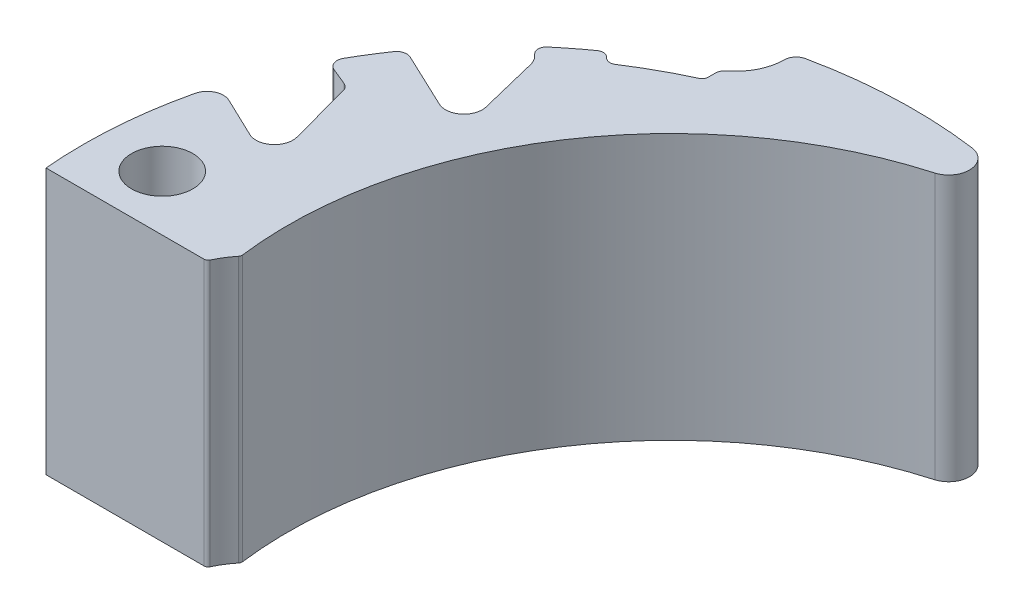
ISO-10303-21;
HEADER;
FILE_DESCRIPTION(('STEP AP214'),'2;1');
FILE_NAME('part.step','',(''),(''),'','','');
FILE_SCHEMA(('AUTOMOTIVE_DESIGN { 1 0 10303 214 1 1 1 1 }'));
ENDSEC;
DATA;
#1=APPLICATION_CONTEXT('core data for automotive mechanical design processes');
#2=APPLICATION_PROTOCOL_DEFINITION('international standard','automotive_design',2000,#1);
#3=PRODUCT_CONTEXT('',#1,'mechanical');
#4=PRODUCT('Part','Part','',(#3));
#5=PRODUCT_RELATED_PRODUCT_CATEGORY('part','',(#4));
#6=PRODUCT_DEFINITION_FORMATION('','',#4);
#7=PRODUCT_DEFINITION_CONTEXT('part definition',#1,'design');
#8=PRODUCT_DEFINITION('design','',#6,#7);
#9=PRODUCT_DEFINITION_SHAPE('','',#8);
#10=(LENGTH_UNIT() NAMED_UNIT(*) SI_UNIT(.MILLI.,.METRE.));
#11=(NAMED_UNIT(*) PLANE_ANGLE_UNIT() SI_UNIT($,.RADIAN.));
#12=(NAMED_UNIT(*) SI_UNIT($,.STERADIAN.) SOLID_ANGLE_UNIT());
#13=UNCERTAINTY_MEASURE_WITH_UNIT(LENGTH_MEASURE(1.E-05),#10,'distance_accuracy_value','');
#14=(GEOMETRIC_REPRESENTATION_CONTEXT(3) GLOBAL_UNCERTAINTY_ASSIGNED_CONTEXT((#13)) GLOBAL_UNIT_ASSIGNED_CONTEXT((#10,
#11,#12)) REPRESENTATION_CONTEXT('',''));
#15=CARTESIAN_POINT('',(0.,0.,0.));
#16=DIRECTION('',(0.,0.,1.));
#17=DIRECTION('',(1.,0.,0.));
#18=AXIS2_PLACEMENT_3D('',#15,#16,#17);
#19=CARTESIAN_POINT('',(144.723717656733,13.,-142.292933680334));
#20=DIRECTION('',(0.,-1.,0.));
#21=DIRECTION('',(0.,0.,-1.));
#22=AXIS2_PLACEMENT_3D('',#19,#20,#21);
#23=CYLINDRICAL_SURFACE('',#22,18.75);
#24=CARTESIAN_POINT('',(144.723717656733,0.,-142.292933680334));
#25=DIRECTION('',(0.,1.,0.));
#26=DIRECTION('',(0.,0.,1.));
#27=AXIS2_PLACEMENT_3D('',#24,#25,#26);
#28=CIRCLE('',#27,18.75);
#29=CARTESIAN_POINT('',(139.594538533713,0.,-160.327733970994));
#30=VERTEX_POINT('',#29);
#31=CARTESIAN_POINT('',(126.124865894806,0.,-139.916967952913));
#32=VERTEX_POINT('',#31);
#33=EDGE_CURVE('E284',#30,#32,#28,.T.);
#34=ORIENTED_EDGE('',*,*,#33,.F.);
#35=DIRECTION('',(0.,-1.,0.));
#36=VECTOR('',#35,1.);
#37=CARTESIAN_POINT('',(139.594538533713,13.,-160.327733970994));
#38=LINE('',#37,#36);
#39=CARTESIAN_POINT('',(139.594538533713,13.,-160.327733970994));
#40=VERTEX_POINT('',#39);
#41=EDGE_CURVE('E11',#40,#30,#38,.T.);
#42=ORIENTED_EDGE('',*,*,#41,.F.);
#43=CARTESIAN_POINT('',(144.723717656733,13.,-142.292933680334));
#44=DIRECTION('',(0.,1.,0.));
#45=DIRECTION('',(0.,0.,1.));
#46=AXIS2_PLACEMENT_3D('',#43,#44,#45);
#47=CIRCLE('',#46,18.75);
#48=CARTESIAN_POINT('',(126.124865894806,13.,-139.916967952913));
#49=VERTEX_POINT('',#48);
#50=EDGE_CURVE('E370',#40,#49,#47,.T.);
#51=ORIENTED_EDGE('',*,*,#50,.T.);
#52=DIRECTION('',(0.,-1.,0.));
#53=VECTOR('',#52,1.);
#54=CARTESIAN_POINT('',(126.124865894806,13.,-139.916967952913));
#55=LINE('',#54,#53);
#56=EDGE_CURVE('E57',#49,#32,#55,.T.);
#57=ORIENTED_EDGE('',*,*,#56,.T.);
#58=EDGE_LOOP('',(#34,#42,#51,#57));
#59=FACE_BOUND('',#58,.T.);
#60=ADVANCED_FACE('F41',(#59),#23,.F.);
#61=CARTESIAN_POINT('',(139.295638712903,13.,-161.297169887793));
#62=DIRECTION('',(0.,-1.,0.));
#63=DIRECTION('',(0.,0.,-1.));
#64=AXIS2_PLACEMENT_3D('',#61,#62,#63);
#65=CYLINDRICAL_SURFACE('',#64,1.01446887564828);
#66=CARTESIAN_POINT('',(139.295638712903,0.,-161.297169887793));
#67=DIRECTION('',(0.,1.,0.));
#68=DIRECTION('',(0.,0.,1.));
#69=AXIS2_PLACEMENT_3D('',#66,#67,#68);
#70=CIRCLE('',#69,1.01446887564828);
#71=CARTESIAN_POINT('',(139.432329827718,0.,-162.302387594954));
#72=VERTEX_POINT('',#71);
#73=EDGE_CURVE('E286',#30,#72,#70,.T.);
#74=ORIENTED_EDGE('',*,*,#73,.T.);
#75=DIRECTION('',(0.,-1.,0.));
#76=VECTOR('',#75,1.);
#77=CARTESIAN_POINT('',(139.432329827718,13.,-162.302387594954));
#78=LINE('',#77,#76);
#79=CARTESIAN_POINT('',(139.432329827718,13.,-162.302387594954));
#80=VERTEX_POINT('',#79);
#81=EDGE_CURVE('E49',#80,#72,#78,.T.);
#82=ORIENTED_EDGE('',*,*,#81,.F.);
#83=CARTESIAN_POINT('',(139.295638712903,13.,-161.297169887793));
#84=DIRECTION('',(0.,1.,0.));
#85=DIRECTION('',(0.,0.,1.));
#86=AXIS2_PLACEMENT_3D('',#83,#84,#85);
#87=CIRCLE('',#86,1.01446887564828);
#88=EDGE_CURVE('E462',#40,#80,#87,.T.);
#89=ORIENTED_EDGE('',*,*,#88,.F.);
#90=ORIENTED_EDGE('',*,*,#41,.T.);
#91=EDGE_LOOP('',(#74,#82,#89,#90));
#92=FACE_BOUND('',#91,.T.);
#93=ADVANCED_FACE('F537',(#92),#65,.T.);
#94=CARTESIAN_POINT('',(136.348769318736,13.,-139.626081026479));
#95=DIRECTION('',(0.,-1.,0.));
#96=DIRECTION('',(0.,0.,-1.));
#97=AXIS2_PLACEMENT_3D('',#94,#95,#96);
#98=CYLINDRICAL_SURFACE('',#97,22.885);
#99=CARTESIAN_POINT('',(136.348769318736,0.,-139.626081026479));
#100=DIRECTION('',(0.,1.,0.));
#101=DIRECTION('',(0.,0.,1.));
#102=AXIS2_PLACEMENT_3D('',#99,#100,#101);
#103=CIRCLE('',#102,22.885);
#104=CARTESIAN_POINT('',(131.569829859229,0.,-162.006540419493));
#105=VERTEX_POINT('',#104);
#106=EDGE_CURVE('E289',#72,#105,#103,.T.);
#107=ORIENTED_EDGE('',*,*,#106,.T.);
#108=DIRECTION('',(0.,-1.,0.));
#109=VECTOR('',#108,1.);
#110=CARTESIAN_POINT('',(131.569829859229,13.,-162.006540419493));
#111=LINE('',#110,#109);
#112=CARTESIAN_POINT('',(131.569829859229,13.,-162.006540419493));
#113=VERTEX_POINT('',#112);
#114=EDGE_CURVE('E434',#113,#105,#111,.T.);
#115=ORIENTED_EDGE('',*,*,#114,.F.);
#116=CARTESIAN_POINT('',(136.348769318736,13.,-139.626081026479));
#117=DIRECTION('',(0.,1.,0.));
#118=DIRECTION('',(0.,0.,1.));
#119=AXIS2_PLACEMENT_3D('',#116,#117,#118);
#120=CIRCLE('',#119,22.885);
#121=EDGE_CURVE('E443',#80,#113,#120,.T.);
#122=ORIENTED_EDGE('',*,*,#121,.F.);
#123=ORIENTED_EDGE('',*,*,#81,.T.);
#124=EDGE_LOOP('',(#107,#115,#122,#123));
#125=FACE_BOUND('',#124,.T.);
#126=ADVANCED_FACE('F441',(#125),#98,.T.);
#127=CARTESIAN_POINT('',(131.691443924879,13.,-161.437004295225));
#128=DIRECTION('',(0.,-1.,0.));
#129=DIRECTION('',(0.,0.,-1.));
#130=AXIS2_PLACEMENT_3D('',#127,#128,#129);
#131=CYLINDRICAL_SURFACE('',#130,0.582375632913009);
#132=CARTESIAN_POINT('',(131.691443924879,0.,-161.437004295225));
#133=DIRECTION('',(0.,1.,0.));
#134=DIRECTION('',(0.,0.,1.));
#135=AXIS2_PLACEMENT_3D('',#132,#133,#134);
#136=CIRCLE('',#135,0.582375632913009);
#137=CARTESIAN_POINT('',(131.109080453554,0.,-161.440767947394));
#138=VERTEX_POINT('',#137);
#139=EDGE_CURVE('E291',#105,#138,#136,.T.);
#140=ORIENTED_EDGE('',*,*,#139,.T.);
#141=DIRECTION('',(0.,-1.,0.));
#142=VECTOR('',#141,1.);
#143=CARTESIAN_POINT('',(131.109080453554,13.,-161.440767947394));
#144=LINE('',#143,#142);
#145=CARTESIAN_POINT('',(131.109080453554,13.,-161.440767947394));
#146=VERTEX_POINT('',#145);
#147=EDGE_CURVE('E432',#146,#138,#144,.T.);
#148=ORIENTED_EDGE('',*,*,#147,.F.);
#149=CARTESIAN_POINT('',(131.691443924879,13.,-161.437004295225));
#150=DIRECTION('',(0.,1.,0.));
#151=DIRECTION('',(0.,0.,1.));
#152=AXIS2_PLACEMENT_3D('',#149,#150,#151);
#153=CIRCLE('',#152,0.582375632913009);
#154=EDGE_CURVE('E456',#113,#146,#153,.T.);
#155=ORIENTED_EDGE('',*,*,#154,.F.);
#156=ORIENTED_EDGE('',*,*,#114,.T.);
#157=EDGE_LOOP('',(#140,#148,#155,#156));
#158=FACE_BOUND('',#157,.T.);
#159=ADVANCED_FACE('F453',(#158),#131,.T.);
#160=CARTESIAN_POINT('',(128.731780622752,13.,-161.456131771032));
#161=DIRECTION('',(0.,-1.,0.));
#162=DIRECTION('',(0.,0.,-1.));
#163=AXIS2_PLACEMENT_3D('',#160,#161,#162);
#164=CYLINDRICAL_SURFACE('',#163,2.37734947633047);
#165=CARTESIAN_POINT('',(128.731780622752,0.,-161.456131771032));
#166=DIRECTION('',(0.,1.,0.));
#167=DIRECTION('',(0.,0.,1.));
#168=AXIS2_PLACEMENT_3D('',#165,#166,#167);
#169=CIRCLE('',#168,2.37734947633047);
#170=CARTESIAN_POINT('',(130.179324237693,0.,-159.57028765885));
#171=VERTEX_POINT('',#170);
#172=EDGE_CURVE('E294',#171,#138,#169,.T.);
#173=ORIENTED_EDGE('',*,*,#172,.F.);
#174=DIRECTION('',(0.,-1.,0.));
#175=VECTOR('',#174,1.);
#176=CARTESIAN_POINT('',(130.179324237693,13.,-159.57028765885));
#177=LINE('',#176,#175);
#178=CARTESIAN_POINT('',(130.179324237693,13.,-159.57028765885));
#179=VERTEX_POINT('',#178);
#180=EDGE_CURVE('E430',#179,#171,#177,.T.);
#181=ORIENTED_EDGE('',*,*,#180,.F.);
#182=CARTESIAN_POINT('',(128.731780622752,13.,-161.456131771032));
#183=DIRECTION('',(0.,1.,0.));
#184=DIRECTION('',(0.,0.,1.));
#185=AXIS2_PLACEMENT_3D('',#182,#183,#184);
#186=CIRCLE('',#185,2.37734947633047);
#187=EDGE_CURVE('E458',#179,#146,#186,.T.);
#188=ORIENTED_EDGE('',*,*,#187,.T.);
#189=ORIENTED_EDGE('',*,*,#147,.T.);
#190=EDGE_LOOP('',(#173,#181,#188,#189));
#191=FACE_BOUND('',#190,.T.);
#192=ADVANCED_FACE('F548',(#191),#164,.F.);
#193=CARTESIAN_POINT('',(130.483769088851,13.,-159.173660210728));
#194=DIRECTION('',(0.,-1.,0.));
#195=DIRECTION('',(0.,0.,-1.));
#196=AXIS2_PLACEMENT_3D('',#193,#194,#195);
#197=CYLINDRICAL_SURFACE('',#196,0.500000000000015);
#198=CARTESIAN_POINT('',(130.483769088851,0.,-159.173660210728));
#199=DIRECTION('',(0.,1.,0.));
#200=DIRECTION('',(0.,0.,1.));
#201=AXIS2_PLACEMENT_3D('',#198,#199,#200);
#202=CIRCLE('',#201,0.500000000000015);
#203=CARTESIAN_POINT('',(129.983769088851,0.,-159.173660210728));
#204=VERTEX_POINT('',#203);
#205=EDGE_CURVE('E297',#171,#204,#202,.T.);
#206=ORIENTED_EDGE('',*,*,#205,.T.);
#207=DIRECTION('',(0.,-1.,0.));
#208=VECTOR('',#207,1.);
#209=CARTESIAN_POINT('',(129.983769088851,13.,-159.173660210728));
#210=LINE('',#209,#208);
#211=CARTESIAN_POINT('',(129.983769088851,13.,-159.173660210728));
#212=VERTEX_POINT('',#211);
#213=EDGE_CURVE('E428',#212,#204,#210,.T.);
#214=ORIENTED_EDGE('',*,*,#213,.F.);
#215=CARTESIAN_POINT('',(130.483769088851,13.,-159.173660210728));
#216=DIRECTION('',(0.,1.,0.));
#217=DIRECTION('',(0.,0.,1.));
#218=AXIS2_PLACEMENT_3D('',#215,#216,#217);
#219=CIRCLE('',#218,0.500000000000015);
#220=EDGE_CURVE('E460',#179,#212,#219,.T.);
#221=ORIENTED_EDGE('',*,*,#220,.F.);
#222=ORIENTED_EDGE('',*,*,#180,.T.);
#223=EDGE_LOOP('',(#206,#214,#221,#222));
#224=FACE_BOUND('',#223,.T.);
#225=ADVANCED_FACE('F551',(#224),#197,.T.);
#226=CARTESIAN_POINT('',(129.983769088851,13.,0.));
#227=DIRECTION('',(-1.,0.,0.));
#228=DIRECTION('',(0.,0.,1.));
#229=AXIS2_PLACEMENT_3D('',#226,#227,#228);
#230=PLANE('',#229);
#231=DIRECTION('',(0.,0.,-1.));
#232=VECTOR('',#231,1.);
#233=CARTESIAN_POINT('',(129.983769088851,0.,0.));
#234=LINE('',#233,#232);
#235=CARTESIAN_POINT('',(129.983769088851,0.,-158.839172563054));
#236=VERTEX_POINT('',#235);
#237=EDGE_CURVE('E300',#236,#204,#234,.T.);
#238=ORIENTED_EDGE('',*,*,#237,.F.);
#239=DIRECTION('',(0.,-1.,0.));
#240=VECTOR('',#239,1.);
#241=CARTESIAN_POINT('',(129.983769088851,13.,-158.839172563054));
#242=LINE('',#241,#240);
#243=CARTESIAN_POINT('',(129.983769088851,13.,-158.839172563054));
#244=VERTEX_POINT('',#243);
#245=EDGE_CURVE('E426',#244,#236,#242,.T.);
#246=ORIENTED_EDGE('',*,*,#245,.F.);
#247=DIRECTION('',(0.,0.,-1.));
#248=VECTOR('',#247,1.);
#249=CARTESIAN_POINT('',(129.983769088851,13.,0.));
#250=LINE('',#249,#248);
#251=EDGE_CURVE('E467',#244,#212,#250,.T.);
#252=ORIENTED_EDGE('',*,*,#251,.T.);
#253=ORIENTED_EDGE('',*,*,#213,.T.);
#254=EDGE_LOOP('',(#238,#246,#252,#253));
#255=FACE_BOUND('',#254,.T.);
#256=ADVANCED_FACE('F555',(#255),#230,.T.);
#257=CARTESIAN_POINT('',(129.683769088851,13.,-158.839172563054));
#258=DIRECTION('',(0.,-1.,0.));
#259=DIRECTION('',(0.,0.,-1.));
#260=AXIS2_PLACEMENT_3D('',#257,#258,#259);
#261=CYLINDRICAL_SURFACE('',#260,0.300000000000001);
#262=CARTESIAN_POINT('',(129.683769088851,0.,-158.839172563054));
#263=DIRECTION('',(0.,1.,0.));
#264=DIRECTION('',(0.,0.,1.));
#265=AXIS2_PLACEMENT_3D('',#262,#263,#264);
#266=CIRCLE('',#265,0.300000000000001);
#267=CARTESIAN_POINT('',(129.807926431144,0.,-158.566070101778));
#268=VERTEX_POINT('',#267);
#269=EDGE_CURVE('E303',#236,#268,#266,.F.);
#270=ORIENTED_EDGE('',*,*,#269,.T.);
#271=DIRECTION('',(0.,-1.,0.));
#272=VECTOR('',#271,1.);
#273=CARTESIAN_POINT('',(129.807926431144,13.,-158.566070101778));
#274=LINE('',#273,#272);
#275=CARTESIAN_POINT('',(129.807926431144,13.,-158.566070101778));
#276=VERTEX_POINT('',#275);
#277=EDGE_CURVE('E423',#276,#268,#274,.T.);
#278=ORIENTED_EDGE('',*,*,#277,.F.);
#279=CARTESIAN_POINT('',(129.683769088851,13.,-158.839172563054));
#280=DIRECTION('',(0.,1.,0.));
#281=DIRECTION('',(0.,0.,1.));
#282=AXIS2_PLACEMENT_3D('',#279,#280,#281);
#283=CIRCLE('',#282,0.300000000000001);
#284=EDGE_CURVE('E470',#244,#276,#283,.F.);
#285=ORIENTED_EDGE('',*,*,#284,.F.);
#286=ORIENTED_EDGE('',*,*,#245,.T.);
#287=EDGE_LOOP('',(#270,#278,#285,#286));
#288=FACE_BOUND('',#287,.T.);
#289=ADVANCED_FACE('F559',(#288),#261,.F.);
#290=CARTESIAN_POINT('',(137.898846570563,13.,-140.768893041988));
#291=DIRECTION('',(0.,-1.,0.));
#292=DIRECTION('',(0.,0.,-1.));
#293=AXIS2_PLACEMENT_3D('',#290,#291,#292);
#294=CYLINDRICAL_SURFACE('',#293,19.55);
#295=CARTESIAN_POINT('',(137.898846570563,0.,-140.768893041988));
#296=DIRECTION('',(0.,1.,0.));
#297=DIRECTION('',(0.,0.,1.));
#298=AXIS2_PLACEMENT_3D('',#295,#296,#297);
#299=CIRCLE('',#298,19.55);
#300=CARTESIAN_POINT('',(127.183464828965,0.,-157.120745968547));
#301=VERTEX_POINT('',#300);
#302=EDGE_CURVE('E305',#268,#301,#299,.T.);
#303=ORIENTED_EDGE('',*,*,#302,.T.);
#304=DIRECTION('',(0.,-1.,0.));
#305=VECTOR('',#304,1.);
#306=CARTESIAN_POINT('',(127.183464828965,13.,-157.120745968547));
#307=LINE('',#306,#305);
#308=CARTESIAN_POINT('',(127.183464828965,13.,-157.120745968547));
#309=VERTEX_POINT('',#308);
#310=EDGE_CURVE('E420',#309,#301,#307,.T.);
#311=ORIENTED_EDGE('',*,*,#310,.F.);
#312=CARTESIAN_POINT('',(137.898846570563,13.,-140.768893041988));
#313=DIRECTION('',(0.,1.,0.));
#314=DIRECTION('',(0.,0.,1.));
#315=AXIS2_PLACEMENT_3D('',#312,#313,#314);
#316=CIRCLE('',#315,19.55);
#317=EDGE_CURVE('E472',#276,#309,#316,.T.);
#318=ORIENTED_EDGE('',*,*,#317,.F.);
#319=ORIENTED_EDGE('',*,*,#277,.T.);
#320=EDGE_LOOP('',(#303,#311,#318,#319));
#321=FACE_BOUND('',#320,.T.);
#322=ADVANCED_FACE('F563',(#321),#294,.T.);
#323=CARTESIAN_POINT('',(126.964224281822,13.,-157.455310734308));
#324=DIRECTION('',(0.,-1.,0.));
#325=DIRECTION('',(0.,0.,-1.));
#326=AXIS2_PLACEMENT_3D('',#323,#324,#325);
#327=CYLINDRICAL_SURFACE('',#326,0.399999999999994);
#328=CARTESIAN_POINT('',(126.964224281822,0.,-157.455310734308));
#329=DIRECTION('',(0.,1.,0.));
#330=DIRECTION('',(0.,0.,1.));
#331=AXIS2_PLACEMENT_3D('',#328,#329,#330);
#332=CIRCLE('',#331,0.399999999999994);
#333=CARTESIAN_POINT('',(126.667017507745,0.,-157.187601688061));
#334=VERTEX_POINT('',#333);
#335=EDGE_CURVE('E307',#301,#334,#332,.F.);
#336=ORIENTED_EDGE('',*,*,#335,.T.);
#337=DIRECTION('',(0.,-1.,0.));
#338=VECTOR('',#337,1.);
#339=CARTESIAN_POINT('',(126.667017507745,13.,-157.187601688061));
#340=LINE('',#339,#338);
#341=CARTESIAN_POINT('',(126.667017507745,13.,-157.187601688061));
#342=VERTEX_POINT('',#341);
#343=EDGE_CURVE('E418',#342,#334,#340,.T.);
#344=ORIENTED_EDGE('',*,*,#343,.F.);
#345=CARTESIAN_POINT('',(126.964224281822,13.,-157.455310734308));
#346=DIRECTION('',(0.,1.,0.));
#347=DIRECTION('',(0.,0.,1.));
#348=AXIS2_PLACEMENT_3D('',#345,#346,#347);
#349=CIRCLE('',#348,0.399999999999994);
#350=EDGE_CURVE('E474',#309,#342,#349,.F.);
#351=ORIENTED_EDGE('',*,*,#350,.F.);
#352=ORIENTED_EDGE('',*,*,#310,.T.);
#353=EDGE_LOOP('',(#336,#344,#351,#352));
#354=FACE_BOUND('',#353,.T.);
#355=ADVANCED_FACE('F567',(#354),#327,.F.);
#356=CARTESIAN_POINT('',(148.095978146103,13.,-133.397474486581));
#357=DIRECTION('',(0.743016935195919,0.,-0.66927261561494));
#358=DIRECTION('',(-0.66927261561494,0.,-0.743016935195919));
#359=AXIS2_PLACEMENT_3D('',#356,#357,#358);
#360=PLANE('',#359);
#361=DIRECTION('',(0.66927261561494,0.,0.743016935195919));
#362=VECTOR('',#361,1.);
#363=CARTESIAN_POINT('',(148.095978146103,0.,-133.397474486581));
#364=LINE('',#363,#362);
#365=CARTESIAN_POINT('',(126.662791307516,0.,-157.192293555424));
#366=VERTEX_POINT('',#365);
#367=EDGE_CURVE('E310',#366,#334,#364,.T.);
#368=ORIENTED_EDGE('',*,*,#367,.F.);
#369=DIRECTION('',(0.,-1.,0.));
#370=VECTOR('',#369,1.);
#371=CARTESIAN_POINT('',(126.662791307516,13.,-157.192293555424));
#372=LINE('',#371,#370);
#373=CARTESIAN_POINT('',(126.662791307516,13.,-157.192293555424));
#374=VERTEX_POINT('',#373);
#375=EDGE_CURVE('E416',#374,#366,#372,.T.);
#376=ORIENTED_EDGE('',*,*,#375,.F.);
#377=DIRECTION('',(0.66927261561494,0.,0.743016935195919));
#378=VECTOR('',#377,1.);
#379=CARTESIAN_POINT('',(148.095978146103,13.,-133.397474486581));
#380=LINE('',#379,#378);
#381=EDGE_CURVE('E476',#374,#342,#380,.T.);
#382=ORIENTED_EDGE('',*,*,#381,.T.);
#383=ORIENTED_EDGE('',*,*,#343,.T.);
#384=EDGE_LOOP('',(#368,#376,#382,#383));
#385=FACE_BOUND('',#384,.T.);
#386=ADVANCED_FACE('F571',(#385),#360,.T.);
#387=CARTESIAN_POINT('',(126.365584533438,13.,-156.924584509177));
#388=DIRECTION('',(0.,-1.,0.));
#389=DIRECTION('',(0.,0.,-1.));
#390=AXIS2_PLACEMENT_3D('',#387,#388,#389);
#391=CYLINDRICAL_SURFACE('',#390,0.4);
#392=CARTESIAN_POINT('',(126.365584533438,0.,-156.924584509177));
#393=DIRECTION('',(0.,1.,0.));
#394=DIRECTION('',(0.,0.,1.));
#395=AXIS2_PLACEMENT_3D('',#392,#393,#394);
#396=CIRCLE('',#395,0.4);
#397=CARTESIAN_POINT('',(126.133176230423,0.,-157.250140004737));
#398=VERTEX_POINT('',#397);
#399=EDGE_CURVE('E313',#398,#366,#396,.F.);
#400=ORIENTED_EDGE('',*,*,#399,.F.);
#401=DIRECTION('',(0.,-1.,0.));
#402=VECTOR('',#401,1.);
#403=CARTESIAN_POINT('',(126.133176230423,13.,-157.250140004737));
#404=LINE('',#403,#402);
#405=CARTESIAN_POINT('',(126.133176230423,13.,-157.250140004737));
#406=VERTEX_POINT('',#405);
#407=EDGE_CURVE('E414',#406,#398,#404,.T.);
#408=ORIENTED_EDGE('',*,*,#407,.F.);
#409=CARTESIAN_POINT('',(126.365584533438,13.,-156.924584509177));
#410=DIRECTION('',(0.,1.,0.));
#411=DIRECTION('',(0.,0.,1.));
#412=AXIS2_PLACEMENT_3D('',#409,#410,#411);
#413=CIRCLE('',#412,0.4);
#414=EDGE_CURVE('E479',#406,#374,#413,.F.);
#415=ORIENTED_EDGE('',*,*,#414,.T.);
#416=ORIENTED_EDGE('',*,*,#375,.T.);
#417=EDGE_LOOP('',(#400,#408,#415,#416));
#418=FACE_BOUND('',#417,.T.);
#419=ADVANCED_FACE('F575',(#418),#391,.T.);
#420=CARTESIAN_POINT('',(137.898846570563,13.,-140.768893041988));
#421=DIRECTION('',(0.,-1.,0.));
#422=DIRECTION('',(0.,0.,-1.));
#423=AXIS2_PLACEMENT_3D('',#420,#421,#422);
#424=CYLINDRICAL_SURFACE('',#423,20.25);
#425=CARTESIAN_POINT('',(137.898846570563,0.,-140.768893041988));
#426=DIRECTION('',(0.,1.,0.));
#427=DIRECTION('',(0.,0.,1.));
#428=AXIS2_PLACEMENT_3D('',#425,#426,#427);
#429=CIRCLE('',#428,20.25);
#430=CARTESIAN_POINT('',(124.765804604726,0.,-156.182708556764));
#431=VERTEX_POINT('',#430);
#432=EDGE_CURVE('E316',#398,#431,#429,.T.);
#433=ORIENTED_EDGE('',*,*,#432,.T.);
#434=DIRECTION('',(0.,-1.,0.));
#435=VECTOR('',#434,1.);
#436=CARTESIAN_POINT('',(124.765804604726,13.,-156.182708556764));
#437=LINE('',#436,#435);
#438=CARTESIAN_POINT('',(124.765804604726,13.,-156.182708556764));
#439=VERTEX_POINT('',#438);
#440=EDGE_CURVE('E411',#439,#431,#437,.T.);
#441=ORIENTED_EDGE('',*,*,#440,.F.);
#442=CARTESIAN_POINT('',(137.898846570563,13.,-140.768893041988));
#443=DIRECTION('',(0.,1.,0.));
#444=DIRECTION('',(0.,0.,1.));
#445=AXIS2_PLACEMENT_3D('',#442,#443,#444);
#446=CIRCLE('',#445,20.25);
#447=EDGE_CURVE('E482',#406,#439,#446,.T.);
#448=ORIENTED_EDGE('',*,*,#447,.F.);
#449=ORIENTED_EDGE('',*,*,#407,.T.);
#450=EDGE_LOOP('',(#433,#441,#448,#449));
#451=FACE_BOUND('',#450,.T.);
#452=ADVANCED_FACE('F579',(#451),#424,.T.);
#453=CARTESIAN_POINT('',(125.025222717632,13.,-155.878238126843));
#454=DIRECTION('',(0.,-1.,0.));
#455=DIRECTION('',(0.,0.,-1.));
#456=AXIS2_PLACEMENT_3D('',#453,#454,#455);
#457=CYLINDRICAL_SURFACE('',#456,0.399999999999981);
#458=CARTESIAN_POINT('',(125.025222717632,0.,-155.878238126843));
#459=DIRECTION('',(0.,1.,0.));
#460=DIRECTION('',(0.,0.,1.));
#461=AXIS2_PLACEMENT_3D('',#458,#459,#460);
#462=CIRCLE('',#461,0.399999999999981);
#463=CARTESIAN_POINT('',(124.742380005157,0.,-155.595395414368));
#464=VERTEX_POINT('',#463);
#465=EDGE_CURVE('E318',#431,#464,#462,.T.);
#466=ORIENTED_EDGE('',*,*,#465,.T.);
#467=DIRECTION('',(0.,-1.,0.));
#468=VECTOR('',#467,1.);
#469=CARTESIAN_POINT('',(124.742380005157,13.,-155.595395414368));
#470=LINE('',#469,#468);
#471=CARTESIAN_POINT('',(124.742380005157,13.,-155.595395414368));
#472=VERTEX_POINT('',#471);
#473=EDGE_CURVE('E408',#472,#464,#470,.T.);
#474=ORIENTED_EDGE('',*,*,#473,.F.);
#475=CARTESIAN_POINT('',(125.025222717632,13.,-155.878238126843));
#476=DIRECTION('',(0.,1.,0.));
#477=DIRECTION('',(0.,0.,1.));
#478=AXIS2_PLACEMENT_3D('',#475,#476,#477);
#479=CIRCLE('',#478,0.399999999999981);
#480=EDGE_CURVE('E484',#439,#472,#479,.T.);
#481=ORIENTED_EDGE('',*,*,#480,.F.);
#482=ORIENTED_EDGE('',*,*,#440,.T.);
#483=EDGE_LOOP('',(#466,#474,#481,#482));
#484=FACE_BOUND('',#483,.T.);
#485=ADVANCED_FACE('F583',(#484),#457,.T.);
#486=CARTESIAN_POINT('',(140.168887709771,13.,-140.168887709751));
#487=DIRECTION('',(0.707106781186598,0.,-0.707106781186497));
#488=DIRECTION('',(-0.707106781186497,0.,-0.707106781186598));
#489=AXIS2_PLACEMENT_3D('',#486,#487,#488);
#490=PLANE('',#489);
#491=DIRECTION('',(0.707106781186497,0.,0.707106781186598));
#492=VECTOR('',#491,1.);
#493=CARTESIAN_POINT('',(140.168887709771,0.,-140.168887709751));
#494=LINE('',#493,#492);
#495=CARTESIAN_POINT('',(124.838741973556,0.,-155.499033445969));
#496=VERTEX_POINT('',#495);
#497=EDGE_CURVE('E320',#464,#496,#494,.T.);
#498=ORIENTED_EDGE('',*,*,#497,.T.);
#499=DIRECTION('',(0.,-1.,0.));
#500=VECTOR('',#499,1.);
#501=CARTESIAN_POINT('',(124.838741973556,13.,-155.499033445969));
#502=LINE('',#501,#500);
#503=CARTESIAN_POINT('',(124.838741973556,13.,-155.499033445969));
#504=VERTEX_POINT('',#503);
#505=EDGE_CURVE('E406',#504,#496,#502,.T.);
#506=ORIENTED_EDGE('',*,*,#505,.F.);
#507=DIRECTION('',(0.707106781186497,0.,0.707106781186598));
#508=VECTOR('',#507,1.);
#509=CARTESIAN_POINT('',(140.168887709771,13.,-140.168887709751));
#510=LINE('',#509,#508);
#511=EDGE_CURVE('E486',#472,#504,#510,.T.);
#512=ORIENTED_EDGE('',*,*,#511,.F.);
#513=ORIENTED_EDGE('',*,*,#473,.T.);
#514=EDGE_LOOP('',(#498,#506,#512,#513));
#515=FACE_BOUND('',#514,.T.);
#516=ADVANCED_FACE('F587',(#515),#490,.F.);
#517=CARTESIAN_POINT('',(124.131635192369,13.,-154.791926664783));
#518=DIRECTION('',(0.,-1.,0.));
#519=DIRECTION('',(0.,0.,-1.));
#520=AXIS2_PLACEMENT_3D('',#517,#518,#519);
#521=CYLINDRICAL_SURFACE('',#520,0.999999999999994);
#522=CARTESIAN_POINT('',(124.131635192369,0.,-154.791926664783));
#523=DIRECTION('',(0.,1.,0.));
#524=DIRECTION('',(0.,0.,1.));
#525=AXIS2_PLACEMENT_3D('',#522,#523,#524);
#526=CIRCLE('',#525,0.999999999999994);
#527=CARTESIAN_POINT('',(125.102738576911,0.,-155.03058587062));
#528=VERTEX_POINT('',#527);
#529=EDGE_CURVE('E323',#528,#496,#526,.T.);
#530=ORIENTED_EDGE('',*,*,#529,.F.);
#531=DIRECTION('',(0.,-1.,0.));
#532=VECTOR('',#531,1.);
#533=CARTESIAN_POINT('',(125.102738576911,13.,-155.03058587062));
#534=LINE('',#533,#532);
#535=CARTESIAN_POINT('',(125.102738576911,13.,-155.03058587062));
#536=VERTEX_POINT('',#535);
#537=EDGE_CURVE('E404',#536,#528,#534,.T.);
#538=ORIENTED_EDGE('',*,*,#537,.F.);
#539=CARTESIAN_POINT('',(124.131635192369,13.,-154.791926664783));
#540=DIRECTION('',(0.,1.,0.));
#541=DIRECTION('',(0.,0.,1.));
#542=AXIS2_PLACEMENT_3D('',#539,#540,#541);
#543=CIRCLE('',#542,0.999999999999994);
#544=EDGE_CURVE('E488',#536,#504,#543,.T.);
#545=ORIENTED_EDGE('',*,*,#544,.T.);
#546=ORIENTED_EDGE('',*,*,#505,.T.);
#547=EDGE_LOOP('',(#530,#538,#545,#546));
#548=FACE_BOUND('',#547,.T.);
#549=ADVANCED_FACE('F591',(#548),#521,.F.);
#550=CARTESIAN_POINT('',(153.907426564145,13.,-37.824421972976));
#551=DIRECTION('',(0.971103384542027,0.,-0.238659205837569));
#552=DIRECTION('',(-0.238659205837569,0.,-0.971103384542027));
#553=AXIS2_PLACEMENT_3D('',#550,#551,#552);
#554=PLANE('',#553);
#555=DIRECTION('',(0.238659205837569,0.,0.971103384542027));
#556=VECTOR('',#555,1.);
#557=CARTESIAN_POINT('',(153.907426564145,0.,-37.824421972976));
#558=LINE('',#557,#556);
#559=CARTESIAN_POINT('',(125.810708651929,0.,-152.149858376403));
#560=VERTEX_POINT('',#559);
#561=EDGE_CURVE('E326',#528,#560,#558,.T.);
#562=ORIENTED_EDGE('',*,*,#561,.T.);
#563=DIRECTION('',(0.,-1.,0.));
#564=VECTOR('',#563,1.);
#565=CARTESIAN_POINT('',(125.810708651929,13.,-152.149858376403));
#566=LINE('',#565,#564);
#567=CARTESIAN_POINT('',(125.810708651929,13.,-152.149858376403));
#568=VERTEX_POINT('',#567);
#569=EDGE_CURVE('E401',#568,#560,#566,.T.);
#570=ORIENTED_EDGE('',*,*,#569,.F.);
#571=DIRECTION('',(0.238659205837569,0.,0.971103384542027));
#572=VECTOR('',#571,1.);
#573=CARTESIAN_POINT('',(153.907426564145,13.,-37.824421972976));
#574=LINE('',#573,#572);
#575=EDGE_CURVE('E491',#536,#568,#574,.T.);
#576=ORIENTED_EDGE('',*,*,#575,.F.);
#577=ORIENTED_EDGE('',*,*,#537,.T.);
#578=EDGE_LOOP('',(#562,#570,#576,#577));
#579=FACE_BOUND('',#578,.T.);
#580=ADVANCED_FACE('F595',(#579),#554,.F.);
#581=CARTESIAN_POINT('',(124.936715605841,13.,-151.935065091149));
#582=DIRECTION('',(0.,-1.,0.));
#583=DIRECTION('',(0.,0.,-1.));
#584=AXIS2_PLACEMENT_3D('',#581,#582,#583);
#585=CYLINDRICAL_SURFACE('',#584,0.900000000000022);
#586=CARTESIAN_POINT('',(124.936715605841,0.,-151.935065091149));
#587=DIRECTION('',(0.,1.,0.));
#588=DIRECTION('',(0.,0.,1.));
#589=AXIS2_PLACEMENT_3D('',#586,#587,#588);
#590=CIRCLE('',#589,0.900000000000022);
#591=CARTESIAN_POINT('',(124.552015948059,0.,-151.121427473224));
#592=VERTEX_POINT('',#591);
#593=EDGE_CURVE('E328',#560,#592,#590,.F.);
#594=ORIENTED_EDGE('',*,*,#593,.T.);
#595=DIRECTION('',(0.,-1.,0.));
#596=VECTOR('',#595,1.);
#597=CARTESIAN_POINT('',(124.552015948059,13.,-151.121427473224));
#598=LINE('',#597,#596);
#599=CARTESIAN_POINT('',(124.552015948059,13.,-151.121427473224));
#600=VERTEX_POINT('',#599);
#601=EDGE_CURVE('E399',#600,#592,#598,.T.);
#602=ORIENTED_EDGE('',*,*,#601,.F.);
#603=CARTESIAN_POINT('',(124.936715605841,13.,-151.935065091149));
#604=DIRECTION('',(0.,1.,0.));
#605=DIRECTION('',(0.,0.,1.));
#606=AXIS2_PLACEMENT_3D('',#603,#604,#605);
#607=CIRCLE('',#606,0.900000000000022);
#608=EDGE_CURVE('E493',#568,#600,#607,.F.);
#609=ORIENTED_EDGE('',*,*,#608,.F.);
#610=ORIENTED_EDGE('',*,*,#569,.T.);
#611=EDGE_LOOP('',(#594,#602,#609,#610));
#612=FACE_BOUND('',#611,.T.);
#613=ADVANCED_FACE('F599',(#612),#585,.F.);
#614=CARTESIAN_POINT('',(81.1541482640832,13.,-171.640568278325));
#615=DIRECTION('',(0.427444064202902,0.,-0.904041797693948));
#616=DIRECTION('',(-0.904041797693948,0.,-0.427444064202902));
#617=AXIS2_PLACEMENT_3D('',#614,#615,#616);
#618=PLANE('',#617);
#619=DIRECTION('',(0.904041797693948,0.,0.427444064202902));
#620=VECTOR('',#619,1.);
#621=CARTESIAN_POINT('',(81.1541482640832,0.,-171.640568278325));
#622=LINE('',#621,#620);
#623=CARTESIAN_POINT('',(121.835104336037,0.,-152.406022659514));
#624=VERTEX_POINT('',#623);
#625=EDGE_CURVE('E331',#624,#592,#622,.T.);
#626=ORIENTED_EDGE('',*,*,#625,.F.);
#627=DIRECTION('',(0.,-1.,0.));
#628=VECTOR('',#627,1.);
#629=CARTESIAN_POINT('',(121.835104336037,13.,-152.406022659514));
#630=LINE('',#629,#628);
#631=CARTESIAN_POINT('',(121.835104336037,13.,-152.406022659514));
#632=VERTEX_POINT('',#631);
#633=EDGE_CURVE('E397',#632,#624,#630,.T.);
#634=ORIENTED_EDGE('',*,*,#633,.F.);
#635=DIRECTION('',(0.904041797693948,0.,0.427444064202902));
#636=VECTOR('',#635,1.);
#637=CARTESIAN_POINT('',(81.1541482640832,13.,-171.640568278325));
#638=LINE('',#637,#636);
#639=EDGE_CURVE('E495',#632,#600,#638,.T.);
#640=ORIENTED_EDGE('',*,*,#639,.T.);
#641=ORIENTED_EDGE('',*,*,#601,.T.);
#642=EDGE_LOOP('',(#626,#634,#640,#641));
#643=FACE_BOUND('',#642,.T.);
#644=ADVANCED_FACE('F603',(#643),#618,.T.);
#645=CARTESIAN_POINT('',(121.621382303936,13.,-151.954001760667));
#646=DIRECTION('',(0.,-1.,0.));
#647=DIRECTION('',(0.,0.,-1.));
#648=AXIS2_PLACEMENT_3D('',#645,#646,#647);
#649=CYLINDRICAL_SURFACE('',#648,0.500000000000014);
#650=CARTESIAN_POINT('',(121.621382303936,0.,-151.954001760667));
#651=DIRECTION('',(0.,1.,0.));
#652=DIRECTION('',(0.,0.,1.));
#653=AXIS2_PLACEMENT_3D('',#650,#651,#652);
#654=CIRCLE('',#653,0.500000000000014);
#655=CARTESIAN_POINT('',(121.209294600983,0.,-152.237169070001));
#656=VERTEX_POINT('',#655);
#657=EDGE_CURVE('E334',#624,#656,#654,.T.);
#658=ORIENTED_EDGE('',*,*,#657,.T.);
#659=DIRECTION('',(0.,-1.,0.));
#660=VECTOR('',#659,1.);
#661=CARTESIAN_POINT('',(121.209294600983,13.,-152.237169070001));
#662=LINE('',#661,#660);
#663=CARTESIAN_POINT('',(121.209294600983,13.,-152.237169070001));
#664=VERTEX_POINT('',#663);
#665=EDGE_CURVE('E394',#664,#656,#662,.T.);
#666=ORIENTED_EDGE('',*,*,#665,.F.);
#667=CARTESIAN_POINT('',(121.621382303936,13.,-151.954001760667));
#668=DIRECTION('',(0.,1.,0.));
#669=DIRECTION('',(0.,0.,1.));
#670=AXIS2_PLACEMENT_3D('',#667,#668,#669);
#671=CIRCLE('',#670,0.500000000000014);
#672=EDGE_CURVE('E498',#632,#664,#671,.T.);
#673=ORIENTED_EDGE('',*,*,#672,.F.);
#674=ORIENTED_EDGE('',*,*,#633,.T.);
#675=EDGE_LOOP('',(#658,#666,#673,#674));
#676=FACE_BOUND('',#675,.T.);
#677=ADVANCED_FACE('F607',(#676),#649,.T.);
#678=CARTESIAN_POINT('',(137.898846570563,13.,-140.768893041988));
#679=DIRECTION('',(0.,-1.,0.));
#680=DIRECTION('',(0.,0.,-1.));
#681=AXIS2_PLACEMENT_3D('',#678,#679,#680);
#682=CYLINDRICAL_SURFACE('',#681,20.25);
#683=CARTESIAN_POINT('',(137.898846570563,0.,-140.768893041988));
#684=DIRECTION('',(0.,1.,0.));
#685=DIRECTION('',(0.,0.,1.));
#686=AXIS2_PLACEMENT_3D('',#683,#684,#685);
#687=CIRCLE('',#686,20.25);
#688=CARTESIAN_POINT('',(120.261292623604,0.,-150.71772165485));
#689=VERTEX_POINT('',#688);
#690=EDGE_CURVE('E336',#656,#689,#687,.T.);
#691=ORIENTED_EDGE('',*,*,#690,.T.);
#692=DIRECTION('',(0.,-1.,0.));
#693=VECTOR('',#692,1.);
#694=CARTESIAN_POINT('',(120.261292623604,13.,-150.71772165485));
#695=LINE('',#694,#693);
#696=CARTESIAN_POINT('',(120.261292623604,13.,-150.71772165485));
#697=VERTEX_POINT('',#696);
#698=EDGE_CURVE('E392',#697,#689,#695,.T.);
#699=ORIENTED_EDGE('',*,*,#698,.F.);
#700=CARTESIAN_POINT('',(137.898846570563,13.,-140.768893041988));
#701=DIRECTION('',(0.,1.,0.));
#702=DIRECTION('',(0.,0.,1.));
#703=AXIS2_PLACEMENT_3D('',#700,#701,#702);
#704=CIRCLE('',#703,20.25);
#705=EDGE_CURVE('E500',#664,#697,#704,.T.);
#706=ORIENTED_EDGE('',*,*,#705,.F.);
#707=ORIENTED_EDGE('',*,*,#665,.T.);
#708=EDGE_LOOP('',(#691,#699,#706,#707));
#709=FACE_BOUND('',#708,.T.);
#710=ADVANCED_FACE('F611',(#709),#682,.T.);
#711=CARTESIAN_POINT('',(120.696787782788,13.,-150.472071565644));
#712=DIRECTION('',(0.,-1.,0.));
#713=DIRECTION('',(0.,0.,-1.));
#714=AXIS2_PLACEMENT_3D('',#711,#712,#713);
#715=CYLINDRICAL_SURFACE('',#714,0.500000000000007);
#716=CARTESIAN_POINT('',(120.696787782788,0.,-150.472071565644));
#717=DIRECTION('',(0.,1.,0.));
#718=DIRECTION('',(0.,0.,1.));
#719=AXIS2_PLACEMENT_3D('',#716,#717,#718);
#720=CIRCLE('',#719,0.500000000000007);
#721=CARTESIAN_POINT('',(120.50735178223,0.,-150.009347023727));
#722=VERTEX_POINT('',#721);
#723=EDGE_CURVE('E339',#722,#689,#720,.F.);
#724=ORIENTED_EDGE('',*,*,#723,.F.);
#725=DIRECTION('',(0.,-1.,0.));
#726=VECTOR('',#725,1.);
#727=CARTESIAN_POINT('',(120.50735178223,13.,-150.009347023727));
#728=LINE('',#727,#726);
#729=CARTESIAN_POINT('',(120.50735178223,13.,-150.009347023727));
#730=VERTEX_POINT('',#729);
#731=EDGE_CURVE('E390',#730,#722,#728,.T.);
#732=ORIENTED_EDGE('',*,*,#731,.F.);
#733=CARTESIAN_POINT('',(120.696787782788,13.,-150.472071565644));
#734=DIRECTION('',(0.,1.,0.));
#735=DIRECTION('',(0.,0.,1.));
#736=AXIS2_PLACEMENT_3D('',#733,#734,#735);
#737=CIRCLE('',#736,0.500000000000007);
#738=EDGE_CURVE('E502',#730,#697,#737,.F.);
#739=ORIENTED_EDGE('',*,*,#738,.T.);
#740=ORIENTED_EDGE('',*,*,#698,.T.);
#741=EDGE_LOOP('',(#724,#732,#739,#740));
#742=FACE_BOUND('',#741,.T.);
#743=ADVANCED_FACE('F615',(#742),#715,.T.);
#744=CARTESIAN_POINT('',(69.8953957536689,13.,-170.729506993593));
#745=DIRECTION('',(0.378872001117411,0.,-0.925449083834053));
#746=DIRECTION('',(-0.925449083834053,0.,-0.378872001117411));
#747=AXIS2_PLACEMENT_3D('',#744,#745,#746);
#748=PLANE('',#747);
#749=DIRECTION('',(0.925449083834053,0.,0.378872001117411));
#750=VECTOR('',#749,1.);
#751=CARTESIAN_POINT('',(69.8953957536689,0.,-170.729506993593));
#752=LINE('',#751,#750);
#753=CARTESIAN_POINT('',(121.334184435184,0.,-149.670847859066));
#754=VERTEX_POINT('',#753);
#755=EDGE_CURVE('E342',#722,#754,#752,.T.);
#756=ORIENTED_EDGE('',*,*,#755,.T.);
#757=DIRECTION('',(0.,-1.,0.));
#758=VECTOR('',#757,1.);
#759=CARTESIAN_POINT('',(121.334184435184,13.,-149.670847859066));
#760=LINE('',#759,#758);
#761=CARTESIAN_POINT('',(121.334184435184,13.,-149.670847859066));
#762=VERTEX_POINT('',#761);
#763=EDGE_CURVE('E388',#762,#754,#760,.T.);
#764=ORIENTED_EDGE('',*,*,#763,.F.);
#765=DIRECTION('',(0.925449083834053,0.,0.378872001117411));
#766=VECTOR('',#765,1.);
#767=CARTESIAN_POINT('',(69.8953957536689,13.,-170.729506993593));
#768=LINE('',#767,#766);
#769=EDGE_CURVE('E505',#730,#762,#768,.T.);
#770=ORIENTED_EDGE('',*,*,#769,.F.);
#771=ORIENTED_EDGE('',*,*,#731,.T.);
#772=EDGE_LOOP('',(#756,#764,#770,#771));
#773=FACE_BOUND('',#772,.T.);
#774=ADVANCED_FACE('F619',(#773),#748,.F.);
#775=CARTESIAN_POINT('',(121.144748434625,13.,-149.208123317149));
#776=DIRECTION('',(0.,-1.,0.));
#777=DIRECTION('',(0.,0.,-1.));
#778=AXIS2_PLACEMENT_3D('',#775,#776,#777);
#779=CYLINDRICAL_SURFACE('',#778,0.50000000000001);
#780=CARTESIAN_POINT('',(121.144748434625,0.,-149.208123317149));
#781=DIRECTION('',(0.,1.,0.));
#782=DIRECTION('',(0.,0.,1.));
#783=AXIS2_PLACEMENT_3D('',#780,#781,#782);
#784=CIRCLE('',#783,0.50000000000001);
#785=CARTESIAN_POINT('',(121.62755919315,0.,-149.338099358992));
#786=VERTEX_POINT('',#785);
#787=EDGE_CURVE('E345',#786,#754,#784,.T.);
#788=ORIENTED_EDGE('',*,*,#787,.F.);
#789=DIRECTION('',(0.,-1.,0.));
#790=VECTOR('',#789,1.);
#791=CARTESIAN_POINT('',(121.62755919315,13.,-149.338099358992));
#792=LINE('',#791,#790);
#793=CARTESIAN_POINT('',(121.62755919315,13.,-149.338099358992));
#794=VERTEX_POINT('',#793);
#795=EDGE_CURVE('E386',#794,#786,#792,.T.);
#796=ORIENTED_EDGE('',*,*,#795,.F.);
#797=CARTESIAN_POINT('',(121.144748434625,13.,-149.208123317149));
#798=DIRECTION('',(0.,1.,0.));
#799=DIRECTION('',(0.,0.,1.));
#800=AXIS2_PLACEMENT_3D('',#797,#798,#799);
#801=CIRCLE('',#800,0.50000000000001);
#802=EDGE_CURVE('E507',#794,#762,#801,.T.);
#803=ORIENTED_EDGE('',*,*,#802,.T.);
#804=ORIENTED_EDGE('',*,*,#763,.T.);
#805=EDGE_LOOP('',(#788,#796,#803,#804));
#806=FACE_BOUND('',#805,.T.);
#807=ADVANCED_FACE('F623',(#806),#779,.F.);
#808=CARTESIAN_POINT('',(150.894718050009,13.,-40.6219162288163));
#809=DIRECTION('',(0.965621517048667,0.,-0.259952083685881));
#810=DIRECTION('',(-0.259952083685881,0.,-0.965621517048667));
#811=AXIS2_PLACEMENT_3D('',#808,#809,#810);
#812=PLANE('',#811);
#813=DIRECTION('',(0.259952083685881,0.,0.965621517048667));
#814=VECTOR('',#813,1.);
#815=CARTESIAN_POINT('',(150.894718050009,0.,-40.6219162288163));
#816=LINE('',#815,#814);
#817=CARTESIAN_POINT('',(122.460686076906,0.,-146.243354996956));
#818=VERTEX_POINT('',#817);
#819=EDGE_CURVE('E348',#786,#818,#816,.T.);
#820=ORIENTED_EDGE('',*,*,#819,.T.);
#821=DIRECTION('',(0.,-1.,0.));
#822=VECTOR('',#821,1.);
#823=CARTESIAN_POINT('',(122.460686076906,13.,-146.243354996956));
#824=LINE('',#823,#822);
#825=CARTESIAN_POINT('',(122.460686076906,13.,-146.243354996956));
#826=VERTEX_POINT('',#825);
#827=EDGE_CURVE('E383',#826,#818,#824,.T.);
#828=ORIENTED_EDGE('',*,*,#827,.F.);
#829=DIRECTION('',(0.259952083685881,0.,0.965621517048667));
#830=VECTOR('',#829,1.);
#831=CARTESIAN_POINT('',(150.894718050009,13.,-40.6219162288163));
#832=LINE('',#831,#830);
#833=EDGE_CURVE('E510',#794,#826,#832,.T.);
#834=ORIENTED_EDGE('',*,*,#833,.F.);
#835=ORIENTED_EDGE('',*,*,#795,.T.);
#836=EDGE_LOOP('',(#820,#828,#834,#835));
#837=FACE_BOUND('',#836,.T.);
#838=ADVANCED_FACE('F627',(#837),#812,.F.);
#839=CARTESIAN_POINT('',(121.591626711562,13.,-146.009398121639));
#840=DIRECTION('',(0.,-1.,0.));
#841=DIRECTION('',(0.,0.,-1.));
#842=AXIS2_PLACEMENT_3D('',#839,#840,#841);
#843=CYLINDRICAL_SURFACE('',#842,0.899999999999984);
#844=CARTESIAN_POINT('',(121.591626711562,0.,-146.009398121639));
#845=DIRECTION('',(0.,1.,0.));
#846=DIRECTION('',(0.,0.,1.));
#847=AXIS2_PLACEMENT_3D('',#844,#845,#846);
#848=CIRCLE('',#847,0.899999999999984);
#849=CARTESIAN_POINT('',(121.203265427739,0.,-145.19750187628));
#850=VERTEX_POINT('',#849);
#851=EDGE_CURVE('E350',#818,#850,#848,.F.);
#852=ORIENTED_EDGE('',*,*,#851,.T.);
#853=DIRECTION('',(0.,-1.,0.));
#854=VECTOR('',#853,1.);
#855=CARTESIAN_POINT('',(121.203265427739,13.,-145.19750187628));
#856=LINE('',#855,#854);
#857=CARTESIAN_POINT('',(121.203265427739,13.,-145.19750187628));
#858=VERTEX_POINT('',#857);
#859=EDGE_CURVE('E381',#858,#850,#856,.T.);
#860=ORIENTED_EDGE('',*,*,#859,.F.);
#861=CARTESIAN_POINT('',(121.591626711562,13.,-146.009398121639));
#862=DIRECTION('',(0.,1.,0.));
#863=DIRECTION('',(0.,0.,1.));
#864=AXIS2_PLACEMENT_3D('',#861,#862,#863);
#865=CIRCLE('',#864,0.899999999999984);
#866=EDGE_CURVE('E512',#826,#858,#865,.F.);
#867=ORIENTED_EDGE('',*,*,#866,.F.);
#868=ORIENTED_EDGE('',*,*,#827,.T.);
#869=EDGE_LOOP('',(#852,#860,#867,#868));
#870=FACE_BOUND('',#869,.T.);
#871=ADVANCED_FACE('F631',(#870),#843,.F.);
#872=CARTESIAN_POINT('',(79.0895176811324,13.,-165.342131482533));
#873=DIRECTION('',(0.431512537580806,0.,-0.902106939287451));
#874=DIRECTION('',(-0.902106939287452,0.,-0.431512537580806));
#875=AXIS2_PLACEMENT_3D('',#872,#873,#874);
#876=PLANE('',#875);
#877=DIRECTION('',(0.902106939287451,0.,0.431512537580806));
#878=VECTOR('',#877,1.);
#879=CARTESIAN_POINT('',(79.0895176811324,0.,-165.342131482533));
#880=LINE('',#879,#878);
#881=CARTESIAN_POINT('',(119.235666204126,0.,-146.138680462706));
#882=VERTEX_POINT('',#881);
#883=EDGE_CURVE('E353',#882,#850,#880,.T.);
#884=ORIENTED_EDGE('',*,*,#883,.F.);
#885=DIRECTION('',(0.,-1.,0.));
#886=VECTOR('',#885,1.);
#887=CARTESIAN_POINT('',(119.235666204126,13.,-146.138680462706));
#888=LINE('',#887,#886);
#889=CARTESIAN_POINT('',(119.235666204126,13.,-146.138680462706));
#890=VERTEX_POINT('',#889);
#891=EDGE_CURVE('E379',#890,#882,#888,.T.);
#892=ORIENTED_EDGE('',*,*,#891,.F.);
#893=DIRECTION('',(0.902106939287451,0.,0.431512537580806));
#894=VECTOR('',#893,1.);
#895=CARTESIAN_POINT('',(79.0895176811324,13.,-165.342131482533));
#896=LINE('',#895,#894);
#897=EDGE_CURVE('E514',#890,#858,#896,.T.);
#898=ORIENTED_EDGE('',*,*,#897,.T.);
#899=ORIENTED_EDGE('',*,*,#859,.T.);
#900=EDGE_LOOP('',(#884,#892,#898,#899));
#901=FACE_BOUND('',#900,.T.);
#902=ADVANCED_FACE('F635',(#901),#876,.T.);
#903=CARTESIAN_POINT('',(118.890456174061,13.,-145.416994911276));
#904=DIRECTION('',(0.,-1.,0.));
#905=DIRECTION('',(0.,0.,-1.));
#906=AXIS2_PLACEMENT_3D('',#903,#904,#905);
#907=CYLINDRICAL_SURFACE('',#906,0.800000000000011);
#908=CARTESIAN_POINT('',(118.890456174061,0.,-145.416994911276));
#909=DIRECTION('',(0.,1.,0.));
#910=DIRECTION('',(0.,0.,1.));
#911=AXIS2_PLACEMENT_3D('',#908,#909,#910);
#912=CIRCLE('',#911,0.800000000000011);
#913=CARTESIAN_POINT('',(118.111692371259,0.,-145.600098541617));
#914=VERTEX_POINT('',#913);
#915=EDGE_CURVE('E356',#882,#914,#912,.T.);
#916=ORIENTED_EDGE('',*,*,#915,.T.);
#917=DIRECTION('',(0.,-1.,0.));
#918=VECTOR('',#917,1.);
#919=CARTESIAN_POINT('',(118.111692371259,13.,-145.600098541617));
#920=LINE('',#919,#918);
#921=CARTESIAN_POINT('',(118.111692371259,13.,-145.600098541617));
#922=VERTEX_POINT('',#921);
#923=EDGE_CURVE('E376',#922,#914,#920,.T.);
#924=ORIENTED_EDGE('',*,*,#923,.F.);
#925=CARTESIAN_POINT('',(118.890456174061,13.,-145.416994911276));
#926=DIRECTION('',(0.,1.,0.));
#927=DIRECTION('',(0.,0.,1.));
#928=AXIS2_PLACEMENT_3D('',#925,#926,#927);
#929=CIRCLE('',#928,0.800000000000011);
#930=EDGE_CURVE('E517',#890,#922,#929,.T.);
#931=ORIENTED_EDGE('',*,*,#930,.F.);
#932=ORIENTED_EDGE('',*,*,#891,.T.);
#933=EDGE_LOOP('',(#916,#924,#931,#932));
#934=FACE_BOUND('',#933,.T.);
#935=ADVANCED_FACE('F639',(#934),#907,.T.);
#936=CARTESIAN_POINT('',(138.948614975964,13.,-140.700902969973));
#937=DIRECTION('',(0.,-1.,0.));
#938=DIRECTION('',(0.,0.,-1.));
#939=AXIS2_PLACEMENT_3D('',#936,#937,#938);
#940=CYLINDRICAL_SURFACE('',#939,21.4051269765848);
#941=CARTESIAN_POINT('',(138.948614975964,0.,-140.700902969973));
#942=DIRECTION('',(0.,1.,0.));
#943=DIRECTION('',(0.,0.,1.));
#944=AXIS2_PLACEMENT_3D('',#941,#942,#943);
#945=CIRCLE('',#944,21.4051269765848);
#946=CARTESIAN_POINT('',(117.628461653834,0.,-138.795509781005));
#947=VERTEX_POINT('',#946);
#948=EDGE_CURVE('E358',#914,#947,#945,.T.);
#949=ORIENTED_EDGE('',*,*,#948,.T.);
#950=DIRECTION('',(0.,-1.,0.));
#951=VECTOR('',#950,1.);
#952=CARTESIAN_POINT('',(117.628461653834,13.,-138.795509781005));
#953=LINE('',#952,#951);
#954=CARTESIAN_POINT('',(117.628461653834,13.,-138.795509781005));
#955=VERTEX_POINT('',#954);
#956=EDGE_CURVE('E374',#955,#947,#953,.T.);
#957=ORIENTED_EDGE('',*,*,#956,.F.);
#958=CARTESIAN_POINT('',(138.948614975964,13.,-140.700902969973));
#959=DIRECTION('',(0.,1.,0.));
#960=DIRECTION('',(0.,0.,1.));
#961=AXIS2_PLACEMENT_3D('',#958,#959,#960);
#962=CIRCLE('',#961,21.4051269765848);
#963=EDGE_CURVE('E519',#922,#955,#962,.T.);
#964=ORIENTED_EDGE('',*,*,#963,.F.);
#965=ORIENTED_EDGE('',*,*,#923,.T.);
#966=EDGE_LOOP('',(#949,#957,#964,#965));
#967=FACE_BOUND('',#966,.T.);
#968=ADVANCED_FACE('F643',(#967),#940,.T.);
#969=CARTESIAN_POINT('',(0.,13.,-138.795509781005));
#970=DIRECTION('',(0.,0.,1.));
#971=DIRECTION('',(1.,0.,0.));
#972=AXIS2_PLACEMENT_3D('',#969,#970,#971);
#973=PLANE('',#972);
#974=DIRECTION('',(-1.,0.,0.));
#975=VECTOR('',#974,1.);
#976=CARTESIAN_POINT('',(0.,0.,-138.795509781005));
#977=LINE('',#976,#975);
#978=CARTESIAN_POINT('',(125.366202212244,0.,-138.795509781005));
#979=VERTEX_POINT('',#978);
#980=EDGE_CURVE('E361',#979,#947,#977,.T.);
#981=ORIENTED_EDGE('',*,*,#980,.F.);
#982=DIRECTION('',(0.,-1.,0.));
#983=VECTOR('',#982,1.);
#984=CARTESIAN_POINT('',(125.366202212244,13.,-138.795509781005));
#985=LINE('',#984,#983);
#986=CARTESIAN_POINT('',(125.366202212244,13.,-138.795509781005));
#987=VERTEX_POINT('',#986);
#988=EDGE_CURVE('E266',#987,#979,#985,.T.);
#989=ORIENTED_EDGE('',*,*,#988,.F.);
#990=DIRECTION('',(-1.,0.,0.));
#991=VECTOR('',#990,1.);
#992=CARTESIAN_POINT('',(0.,13.,-138.795509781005));
#993=LINE('',#992,#991);
#994=EDGE_CURVE('E276',#987,#955,#993,.T.);
#995=ORIENTED_EDGE('',*,*,#994,.T.);
#996=ORIENTED_EDGE('',*,*,#956,.T.);
#997=EDGE_LOOP('',(#981,#989,#995,#996));
#998=FACE_BOUND('',#997,.T.);
#999=ADVANCED_FACE('F522',(#998),#973,.T.);
#1000=CARTESIAN_POINT('',(125.366202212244,13.,-138.995509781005));
#1001=DIRECTION('',(0.,-1.,0.));
#1002=DIRECTION('',(0.,0.,-1.));
#1003=AXIS2_PLACEMENT_3D('',#1000,#1001,#1002);
#1004=CYLINDRICAL_SURFACE('',#1003,0.199999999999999);
#1005=CARTESIAN_POINT('',(125.366202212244,0.,-138.995509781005));
#1006=DIRECTION('',(0.,1.,0.));
#1007=DIRECTION('',(0.,0.,1.));
#1008=AXIS2_PLACEMENT_3D('',#1005,#1006,#1007);
#1009=CIRCLE('',#1008,0.199999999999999);
#1010=CARTESIAN_POINT('',(125.547650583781,0.,-138.911387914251));
#1011=VERTEX_POINT('',#1010);
#1012=EDGE_CURVE('E262',#1011,#979,#1009,.F.);
#1013=ORIENTED_EDGE('',*,*,#1012,.F.);
#1014=DIRECTION('',(0.,-1.,0.));
#1015=VECTOR('',#1014,1.);
#1016=CARTESIAN_POINT('',(125.547650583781,13.,-138.911387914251));
#1017=LINE('',#1016,#1015);
#1018=CARTESIAN_POINT('',(125.547650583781,13.,-138.911387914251));
#1019=VERTEX_POINT('',#1018);
#1020=EDGE_CURVE('E257',#1019,#1011,#1017,.T.);
#1021=ORIENTED_EDGE('',*,*,#1020,.F.);
#1022=CARTESIAN_POINT('',(125.366202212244,13.,-138.995509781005));
#1023=DIRECTION('',(0.,1.,0.));
#1024=DIRECTION('',(0.,0.,1.));
#1025=AXIS2_PLACEMENT_3D('',#1022,#1023,#1024);
#1026=CIRCLE('',#1025,0.199999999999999);
#1027=EDGE_CURVE('E260',#1019,#987,#1026,.F.);
#1028=ORIENTED_EDGE('',*,*,#1027,.T.);
#1029=ORIENTED_EDGE('',*,*,#988,.T.);
#1030=EDGE_LOOP('',(#1013,#1021,#1028,#1029));
#1031=FACE_BOUND('',#1030,.T.);
#1032=ADVANCED_FACE('F259',(#1031),#1004,.T.);
#1033=CARTESIAN_POINT('',(129.222330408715,13.,-137.207757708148));
#1034=DIRECTION('',(0.,-1.,0.));
#1035=DIRECTION('',(0.,0.,-1.));
#1036=AXIS2_PLACEMENT_3D('',#1033,#1034,#1035);
#1037=CYLINDRICAL_SURFACE('',#1036,4.05038611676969);
#1038=CARTESIAN_POINT('',(129.222330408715,0.,-137.207757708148));
#1039=DIRECTION('',(0.,1.,0.));
#1040=DIRECTION('',(0.,0.,1.));
#1041=AXIS2_PLACEMENT_3D('',#1038,#1039,#1040);
#1042=CIRCLE('',#1041,4.05038611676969);
#1043=CARTESIAN_POINT('',(126.081562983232,0.,-139.765336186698));
#1044=VERTEX_POINT('',#1043);
#1045=EDGE_CURVE('E365',#1044,#1011,#1042,.T.);
#1046=ORIENTED_EDGE('',*,*,#1045,.F.);
#1047=DIRECTION('',(0.,-1.,0.));
#1048=VECTOR('',#1047,1.);
#1049=CARTESIAN_POINT('',(126.081562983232,13.,-139.765336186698));
#1050=LINE('',#1049,#1048);
#1051=CARTESIAN_POINT('',(126.081562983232,13.,-139.765336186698));
#1052=VERTEX_POINT('',#1051);
#1053=EDGE_CURVE('E157',#1052,#1044,#1050,.T.);
#1054=ORIENTED_EDGE('',*,*,#1053,.F.);
#1055=CARTESIAN_POINT('',(129.222330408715,13.,-137.207757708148));
#1056=DIRECTION('',(0.,1.,0.));
#1057=DIRECTION('',(0.,0.,1.));
#1058=AXIS2_PLACEMENT_3D('',#1055,#1056,#1057);
#1059=CIRCLE('',#1058,4.05038611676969);
#1060=EDGE_CURVE('E274',#1052,#1019,#1059,.T.);
#1061=ORIENTED_EDGE('',*,*,#1060,.T.);
#1062=ORIENTED_EDGE('',*,*,#1020,.T.);
#1063=EDGE_LOOP('',(#1046,#1054,#1061,#1062));
#1064=FACE_BOUND('',#1063,.T.);
#1065=ADVANCED_FACE('F278',(#1064),#1037,.F.);
#1066=CARTESIAN_POINT('',(125.926478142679,13.,-139.891624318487));
#1067=DIRECTION('',(0.,-1.,0.));
#1068=DIRECTION('',(0.,0.,-1.));
#1069=AXIS2_PLACEMENT_3D('',#1066,#1067,#1068);
#1070=CYLINDRICAL_SURFACE('',#1069,0.200000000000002);
#1071=CARTESIAN_POINT('',(125.926478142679,0.,-139.891624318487));
#1072=DIRECTION('',(0.,1.,0.));
#1073=DIRECTION('',(0.,0.,1.));
#1074=AXIS2_PLACEMENT_3D('',#1071,#1072,#1073);
#1075=CIRCLE('',#1074,0.200000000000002);
#1076=EDGE_CURVE('E367',#32,#1044,#1075,.F.);
#1077=ORIENTED_EDGE('',*,*,#1076,.F.);
#1078=ORIENTED_EDGE('',*,*,#56,.F.);
#1079=CARTESIAN_POINT('',(125.926478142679,13.,-139.891624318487));
#1080=DIRECTION('',(0.,1.,0.));
#1081=DIRECTION('',(0.,0.,1.));
#1082=AXIS2_PLACEMENT_3D('',#1079,#1080,#1081);
#1083=CIRCLE('',#1082,0.200000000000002);
#1084=EDGE_CURVE('E279',#49,#1052,#1083,.F.);
#1085=ORIENTED_EDGE('',*,*,#1084,.T.);
#1086=ORIENTED_EDGE('',*,*,#1053,.T.);
#1087=EDGE_LOOP('',(#1077,#1078,#1085,#1086));
#1088=FACE_BOUND('',#1087,.T.);
#1089=ADVANCED_FACE('F525',(#1088),#1070,.T.);
#1090=CARTESIAN_POINT('',(0.,13.,0.));
#1091=DIRECTION('',(0.,1.,0.));
#1092=DIRECTION('',(0.,0.,1.));
#1093=AXIS2_PLACEMENT_3D('',#1090,#1091,#1092);
#1094=PLANE('',#1093);
#1095=CARTESIAN_POINT('',(120.610185,13.,-141.5));
#1096=DIRECTION('',(0.,1.,0.));
#1097=DIRECTION('',(0.,0.,1.));
#1098=AXIS2_PLACEMENT_3D('',#1095,#1096,#1097);
#1099=CIRCLE('',#1098,1.5);
#1100=CARTESIAN_POINT('',(120.610185,13.,-140.));
#1101=VERTEX_POINT('',#1100);
#1102=EDGE_CURVE('E287',#1101,#1101,#1099,.T.);
#1103=ORIENTED_EDGE('',*,*,#1102,.F.);
#1104=EDGE_LOOP('',(#1103));
#1105=FACE_BOUND('',#1104,.T.);
#1106=ORIENTED_EDGE('',*,*,#50,.F.);
#1107=ORIENTED_EDGE('',*,*,#88,.T.);
#1108=ORIENTED_EDGE('',*,*,#121,.T.);
#1109=ORIENTED_EDGE('',*,*,#154,.T.);
#1110=ORIENTED_EDGE('',*,*,#187,.F.);
#1111=ORIENTED_EDGE('',*,*,#220,.T.);
#1112=ORIENTED_EDGE('',*,*,#251,.F.);
#1113=ORIENTED_EDGE('',*,*,#284,.T.);
#1114=ORIENTED_EDGE('',*,*,#317,.T.);
#1115=ORIENTED_EDGE('',*,*,#350,.T.);
#1116=ORIENTED_EDGE('',*,*,#381,.F.);
#1117=ORIENTED_EDGE('',*,*,#414,.F.);
#1118=ORIENTED_EDGE('',*,*,#447,.T.);
#1119=ORIENTED_EDGE('',*,*,#480,.T.);
#1120=ORIENTED_EDGE('',*,*,#511,.T.);
#1121=ORIENTED_EDGE('',*,*,#544,.F.);
#1122=ORIENTED_EDGE('',*,*,#575,.T.);
#1123=ORIENTED_EDGE('',*,*,#608,.T.);
#1124=ORIENTED_EDGE('',*,*,#639,.F.);
#1125=ORIENTED_EDGE('',*,*,#672,.T.);
#1126=ORIENTED_EDGE('',*,*,#705,.T.);
#1127=ORIENTED_EDGE('',*,*,#738,.F.);
#1128=ORIENTED_EDGE('',*,*,#769,.T.);
#1129=ORIENTED_EDGE('',*,*,#802,.F.);
#1130=ORIENTED_EDGE('',*,*,#833,.T.);
#1131=ORIENTED_EDGE('',*,*,#866,.T.);
#1132=ORIENTED_EDGE('',*,*,#897,.F.);
#1133=ORIENTED_EDGE('',*,*,#930,.T.);
#1134=ORIENTED_EDGE('',*,*,#963,.T.);
#1135=ORIENTED_EDGE('',*,*,#994,.F.);
#1136=ORIENTED_EDGE('',*,*,#1027,.F.);
#1137=ORIENTED_EDGE('',*,*,#1060,.F.);
#1138=ORIENTED_EDGE('',*,*,#1084,.F.);
#1139=EDGE_LOOP('',(#1106,#1107,#1108,#1109,#1110,#1111,#1112,#1113,#1114,#1115,#1116,#1117,
#1118,#1119,#1120,#1121,#1122,#1123,#1124,#1125,#1126,#1127,#1128,#1129,#1130,#1131,#1132,#1133,
#1134,#1135,#1136,#1137,#1138));
#1140=FACE_BOUND('',#1139,.T.);
#1141=ADVANCED_FACE('F272',(#1105,#1140),#1094,.T.);
#1142=CARTESIAN_POINT('',(0.,0.,0.));
#1143=DIRECTION('',(0.,1.,0.));
#1144=DIRECTION('',(0.,0.,1.));
#1145=AXIS2_PLACEMENT_3D('',#1142,#1143,#1144);
#1146=PLANE('',#1145);
#1147=CARTESIAN_POINT('',(120.610185,0.,-141.5));
#1148=DIRECTION('',(0.,1.,0.));
#1149=DIRECTION('',(0.,0.,1.));
#1150=AXIS2_PLACEMENT_3D('',#1147,#1148,#1149);
#1151=CIRCLE('',#1150,1.5);
#1152=CARTESIAN_POINT('',(120.610185,0.,-140.));
#1153=VERTEX_POINT('',#1152);
#1154=EDGE_CURVE('E735',#1153,#1153,#1151,.T.);
#1155=ORIENTED_EDGE('',*,*,#1154,.T.);
#1156=EDGE_LOOP('',(#1155));
#1157=FACE_BOUND('',#1156,.T.);
#1158=ORIENTED_EDGE('',*,*,#33,.T.);
#1159=ORIENTED_EDGE('',*,*,#1076,.T.);
#1160=ORIENTED_EDGE('',*,*,#1045,.T.);
#1161=ORIENTED_EDGE('',*,*,#1012,.T.);
#1162=ORIENTED_EDGE('',*,*,#980,.T.);
#1163=ORIENTED_EDGE('',*,*,#948,.F.);
#1164=ORIENTED_EDGE('',*,*,#915,.F.);
#1165=ORIENTED_EDGE('',*,*,#883,.T.);
#1166=ORIENTED_EDGE('',*,*,#851,.F.);
#1167=ORIENTED_EDGE('',*,*,#819,.F.);
#1168=ORIENTED_EDGE('',*,*,#787,.T.);
#1169=ORIENTED_EDGE('',*,*,#755,.F.);
#1170=ORIENTED_EDGE('',*,*,#723,.T.);
#1171=ORIENTED_EDGE('',*,*,#690,.F.);
#1172=ORIENTED_EDGE('',*,*,#657,.F.);
#1173=ORIENTED_EDGE('',*,*,#625,.T.);
#1174=ORIENTED_EDGE('',*,*,#593,.F.);
#1175=ORIENTED_EDGE('',*,*,#561,.F.);
#1176=ORIENTED_EDGE('',*,*,#529,.T.);
#1177=ORIENTED_EDGE('',*,*,#497,.F.);
#1178=ORIENTED_EDGE('',*,*,#465,.F.);
#1179=ORIENTED_EDGE('',*,*,#432,.F.);
#1180=ORIENTED_EDGE('',*,*,#399,.T.);
#1181=ORIENTED_EDGE('',*,*,#367,.T.);
#1182=ORIENTED_EDGE('',*,*,#335,.F.);
#1183=ORIENTED_EDGE('',*,*,#302,.F.);
#1184=ORIENTED_EDGE('',*,*,#269,.F.);
#1185=ORIENTED_EDGE('',*,*,#237,.T.);
#1186=ORIENTED_EDGE('',*,*,#205,.F.);
#1187=ORIENTED_EDGE('',*,*,#172,.T.);
#1188=ORIENTED_EDGE('',*,*,#139,.F.);
#1189=ORIENTED_EDGE('',*,*,#106,.F.);
#1190=ORIENTED_EDGE('',*,*,#73,.F.);
#1191=EDGE_LOOP('',(#1158,#1159,#1160,#1161,#1162,#1163,#1164,#1165,#1166,#1167,#1168,#1169,
#1170,#1171,#1172,#1173,#1174,#1175,#1176,#1177,#1178,#1179,#1180,#1181,#1182,#1183,#1184,#1185,
#1186,#1187,#1188,#1189,#1190));
#1192=FACE_BOUND('',#1191,.T.);
#1193=ADVANCED_FACE('F448',(#1157,#1192),#1146,.F.);
#1194=CARTESIAN_POINT('',(120.610185,13.,-141.5));
#1195=DIRECTION('',(0.,1.,0.));
#1196=DIRECTION('',(0.,0.,1.));
#1197=AXIS2_PLACEMENT_3D('',#1194,#1195,#1196);
#1198=CYLINDRICAL_SURFACE('',#1197,1.5);
#1199=CARTESIAN_POINT('',(120.610185,8.5,-141.5));
#1200=DIRECTION('',(0.,1.,0.));
#1201=DIRECTION('',(0.,0.,1.));
#1202=AXIS2_PLACEMENT_3D('',#1199,#1200,#1201);
#1203=CIRCLE('',#1202,1.5);
#1204=CARTESIAN_POINT('',(120.610185,8.5,-140.));
#1205=VERTEX_POINT('',#1204);
#1206=EDGE_CURVE('E748',#1205,#1205,#1203,.T.);
#1207=ORIENTED_EDGE('',*,*,#1206,.F.);
#1208=EDGE_LOOP('',(#1207));
#1209=FACE_BOUND('',#1208,.T.);
#1210=ORIENTED_EDGE('',*,*,#1102,.T.);
#1211=EDGE_LOOP('',(#1210));
#1212=FACE_BOUND('',#1211,.T.);
#1213=ADVANCED_FACE('F680',(#1209,#1212),#1198,.F.);
#1214=CARTESIAN_POINT('',(120.610185,8.5,-141.5));
#1215=DIRECTION('',(0.,1.,0.));
#1216=DIRECTION('',(0.,0.,1.));
#1217=AXIS2_PLACEMENT_3D('',#1214,#1215,#1216);
#1218=CONICAL_SURFACE('',#1217,1.5,0.982793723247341);
#1219=CARTESIAN_POINT('',(120.610185,8.,-141.5));
#1220=DIRECTION('',(0.,1.,0.));
#1221=DIRECTION('',(0.,0.,1.));
#1222=AXIS2_PLACEMENT_3D('',#1219,#1220,#1221);
#1223=CIRCLE('',#1222,0.749999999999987);
#1224=CARTESIAN_POINT('',(120.610185,8.,-140.75));
#1225=VERTEX_POINT('',#1224);
#1226=EDGE_CURVE('E742',#1225,#1225,#1223,.T.);
#1227=ORIENTED_EDGE('',*,*,#1226,.F.);
#1228=EDGE_LOOP('',(#1227));
#1229=FACE_BOUND('',#1228,.T.);
#1230=ORIENTED_EDGE('',*,*,#1206,.T.);
#1231=EDGE_LOOP('',(#1230));
#1232=FACE_BOUND('',#1231,.T.);
#1233=ADVANCED_FACE('F689',(#1229,#1232),#1218,.F.);
#1234=CARTESIAN_POINT('',(120.610185,13.,-141.5));
#1235=DIRECTION('',(0.,1.,0.));
#1236=DIRECTION('',(0.,0.,1.));
#1237=AXIS2_PLACEMENT_3D('',#1234,#1235,#1236);
#1238=CYLINDRICAL_SURFACE('',#1237,0.749999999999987);
#1239=CARTESIAN_POINT('',(120.610185,5.,-141.5));
#1240=DIRECTION('',(0.,1.,0.));
#1241=DIRECTION('',(0.,0.,1.));
#1242=AXIS2_PLACEMENT_3D('',#1239,#1240,#1241);
#1243=CIRCLE('',#1242,0.749999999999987);
#1244=CARTESIAN_POINT('',(120.610185,5.,-140.75));
#1245=VERTEX_POINT('',#1244);
#1246=EDGE_CURVE('E739',#1245,#1245,#1243,.T.);
#1247=ORIENTED_EDGE('',*,*,#1246,.F.);
#1248=EDGE_LOOP('',(#1247));
#1249=FACE_BOUND('',#1248,.T.);
#1250=ORIENTED_EDGE('',*,*,#1226,.T.);
#1251=EDGE_LOOP('',(#1250));
#1252=FACE_BOUND('',#1251,.T.);
#1253=ADVANCED_FACE('F699',(#1249,#1252),#1238,.F.);
#1254=CARTESIAN_POINT('',(120.610185,5.,-141.5));
#1255=DIRECTION('',(0.,-1.,0.));
#1256=DIRECTION('',(0.,0.,-1.));
#1257=AXIS2_PLACEMENT_3D('',#1254,#1255,#1256);
#1258=CONICAL_SURFACE('',#1257,0.749999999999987,0.982793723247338);
#1259=CARTESIAN_POINT('',(120.610185,4.5,-141.5));
#1260=DIRECTION('',(0.,1.,0.));
#1261=DIRECTION('',(0.,0.,1.));
#1262=AXIS2_PLACEMENT_3D('',#1259,#1260,#1261);
#1263=CIRCLE('',#1262,1.5);
#1264=CARTESIAN_POINT('',(120.610185,4.5,-140.));
#1265=VERTEX_POINT('',#1264);
#1266=EDGE_CURVE('E738',#1265,#1265,#1263,.T.);
#1267=ORIENTED_EDGE('',*,*,#1266,.F.);
#1268=EDGE_LOOP('',(#1267));
#1269=FACE_BOUND('',#1268,.T.);
#1270=ORIENTED_EDGE('',*,*,#1246,.T.);
#1271=EDGE_LOOP('',(#1270));
#1272=FACE_BOUND('',#1271,.T.);
#1273=ADVANCED_FACE('F709',(#1269,#1272),#1258,.F.);
#1274=CARTESIAN_POINT('',(120.610185,13.,-141.5));
#1275=DIRECTION('',(0.,1.,0.));
#1276=DIRECTION('',(0.,0.,1.));
#1277=AXIS2_PLACEMENT_3D('',#1274,#1275,#1276);
#1278=CYLINDRICAL_SURFACE('',#1277,1.5);
#1279=ORIENTED_EDGE('',*,*,#1154,.F.);
#1280=EDGE_LOOP('',(#1279));
#1281=FACE_BOUND('',#1280,.T.);
#1282=ORIENTED_EDGE('',*,*,#1266,.T.);
#1283=EDGE_LOOP('',(#1282));
#1284=FACE_BOUND('',#1283,.T.);
#1285=ADVANCED_FACE('F719',(#1281,#1284),#1278,.F.);
#1286=CLOSED_SHELL('',(#60,#93,#126,#159,#192,#225,#256,#289,#322,#355,#386,#419,#452,#485,#516,
#549,#580,#613,#644,#677,#710,#743,#774,#807,#838,#871,#902,#935,#968,#999,#1032,#1065,#1089,
#1141,#1193,#1213,#1233,#1253,#1273,#1285));
#1287=MANIFOLD_SOLID_BREP('B2',#1286);
#1288=ADVANCED_BREP_SHAPE_REPRESENTATION('',(#18,#1287),#14);
#1289=SHAPE_DEFINITION_REPRESENTATION(#9,#1288);
ENDSEC;
END-ISO-10303-21;
